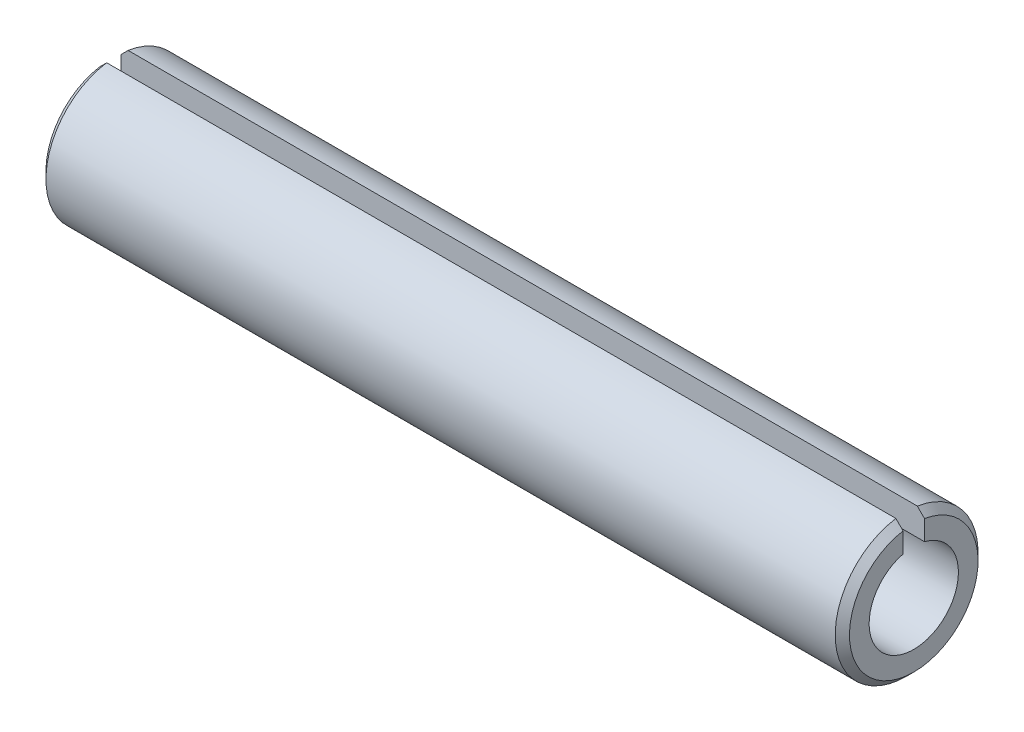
ISO-10303-21;
HEADER;
FILE_DESCRIPTION(('STEP AP214'),'2;1');
FILE_NAME('part.step','',(''),(''),'','','');
FILE_SCHEMA(('AUTOMOTIVE_DESIGN { 1 0 10303 214 1 1 1 1 }'));
ENDSEC;
DATA;
#1=APPLICATION_CONTEXT('core data for automotive mechanical design processes');
#2=APPLICATION_PROTOCOL_DEFINITION('international standard','automotive_design',2000,#1);
#3=PRODUCT_CONTEXT('',#1,'mechanical');
#4=PRODUCT('Part','Part','',(#3));
#5=PRODUCT_RELATED_PRODUCT_CATEGORY('part','',(#4));
#6=PRODUCT_DEFINITION_FORMATION('','',#4);
#7=PRODUCT_DEFINITION_CONTEXT('part definition',#1,'design');
#8=PRODUCT_DEFINITION('design','',#6,#7);
#9=PRODUCT_DEFINITION_SHAPE('','',#8);
#10=(LENGTH_UNIT() NAMED_UNIT(*) SI_UNIT(.MILLI.,.METRE.));
#11=(NAMED_UNIT(*) PLANE_ANGLE_UNIT() SI_UNIT($,.RADIAN.));
#12=(NAMED_UNIT(*) SI_UNIT($,.STERADIAN.) SOLID_ANGLE_UNIT());
#13=UNCERTAINTY_MEASURE_WITH_UNIT(LENGTH_MEASURE(1.E-05),#10,'distance_accuracy_value','');
#14=(GEOMETRIC_REPRESENTATION_CONTEXT(3) GLOBAL_UNCERTAINTY_ASSIGNED_CONTEXT((#13)) GLOBAL_UNIT_ASSIGNED_CONTEXT((#10,
#11,#12)) REPRESENTATION_CONTEXT('',''));
#15=CARTESIAN_POINT('',(0.,0.,0.));
#16=DIRECTION('',(0.,0.,1.));
#17=DIRECTION('',(1.,0.,0.));
#18=AXIS2_PLACEMENT_3D('',#15,#16,#17);
#19=CARTESIAN_POINT('',(0.,3.88578058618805E-13,0.));
#20=DIRECTION('',(-1.,0.,0.));
#21=DIRECTION('',(0.,0.,1.));
#22=AXIS2_PLACEMENT_3D('',#19,#20,#21);
#23=CYLINDRICAL_SURFACE('',#22,2.5);
#24=DIRECTION('',(-1.,0.,0.));
#25=VECTOR('',#24,1.);
#26=CARTESIAN_POINT('',(45.0000000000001,2.42693221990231,0.600000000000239));
#27=LINE('',#26,#25);
#28=CARTESIAN_POINT('',(45.0000000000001,2.42693221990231,0.600000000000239));
#29=VERTEX_POINT('',#28);
#30=CARTESIAN_POINT('',(0.,2.42693221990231,0.599999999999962));
#31=VERTEX_POINT('',#30);
#32=EDGE_CURVE('E45',#29,#31,#27,.T.);
#33=ORIENTED_EDGE('',*,*,#32,.F.);
#34=CARTESIAN_POINT('',(45.0000000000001,3.88578058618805E-13,-1.38777878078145E-13));
#35=DIRECTION('',(-1.,0.,0.));
#36=DIRECTION('',(0.,0.,1.));
#37=AXIS2_PLACEMENT_3D('',#34,#35,#36);
#38=CIRCLE('',#37,2.5);
#39=CARTESIAN_POINT('',(45.0000000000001,2.42693221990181,-0.600000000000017));
#40=VERTEX_POINT('',#39);
#41=EDGE_CURVE('E87',#40,#29,#38,.T.);
#42=ORIENTED_EDGE('',*,*,#41,.F.);
#43=DIRECTION('',(-1.,0.,0.));
#44=VECTOR('',#43,1.);
#45=CARTESIAN_POINT('',(45.0000000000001,2.42693221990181,-0.600000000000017));
#46=LINE('',#45,#44);
#47=CARTESIAN_POINT('',(0.,2.42693221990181,-0.599999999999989));
#48=VERTEX_POINT('',#47);
#49=EDGE_CURVE('E81',#40,#48,#46,.T.);
#50=ORIENTED_EDGE('',*,*,#49,.T.);
#51=CARTESIAN_POINT('',(0.,3.88578058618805E-13,0.));
#52=DIRECTION('',(-1.,0.,0.));
#53=DIRECTION('',(0.,0.,1.));
#54=AXIS2_PLACEMENT_3D('',#51,#52,#53);
#55=CIRCLE('',#54,2.5);
#56=EDGE_CURVE('E91',#48,#31,#55,.T.);
#57=ORIENTED_EDGE('',*,*,#56,.T.);
#58=EDGE_LOOP('',(#33,#42,#50,#57));
#59=FACE_BOUND('',#58,.T.);
#60=ADVANCED_FACE('F31',(#59),#23,.F.);
#61=CARTESIAN_POINT('',(45.,2.50000000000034,-1.66533453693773E-13));
#62=DIRECTION('',(-1.,0.,0.));
#63=DIRECTION('',(0.,0.,1.));
#64=AXIS2_PLACEMENT_3D('',#61,#62,#63);
#65=PLANE('',#64);
#66=DIRECTION('',(0.,-0.999999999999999,0.));
#67=VECTOR('',#66,1.);
#68=CARTESIAN_POINT('',(45.0000000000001,3.95474398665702,0.599999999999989));
#69=LINE('',#68,#67);
#70=CARTESIAN_POINT('',(45.0000000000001,3.54964786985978,0.599999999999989));
#71=VERTEX_POINT('',#70);
#72=EDGE_CURVE('E123',#71,#29,#69,.T.);
#73=ORIENTED_EDGE('',*,*,#72,.F.);
#74=CARTESIAN_POINT('',(45.0000000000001,3.88578058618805E-13,-1.38777878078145E-13));
#75=DIRECTION('',(-1.,0.,0.));
#76=DIRECTION('',(0.,0.,1.));
#77=AXIS2_PLACEMENT_3D('',#74,#75,#76);
#78=CIRCLE('',#77,3.60000000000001);
#79=CARTESIAN_POINT('',(45.,3.54964786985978,-0.600000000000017));
#80=VERTEX_POINT('',#79);
#81=EDGE_CURVE('E116',#80,#71,#78,.T.);
#82=ORIENTED_EDGE('',*,*,#81,.F.);
#83=DIRECTION('',(0.,-0.999999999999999,0.));
#84=VECTOR('',#83,1.);
#85=CARTESIAN_POINT('',(45.0000000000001,3.95474398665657,-0.6000000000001));
#86=LINE('',#85,#84);
#87=EDGE_CURVE('E124',#80,#40,#86,.T.);
#88=ORIENTED_EDGE('',*,*,#87,.T.);
#89=ORIENTED_EDGE('',*,*,#41,.T.);
#90=EDGE_LOOP('',(#73,#82,#88,#89));
#91=FACE_BOUND('',#90,.T.);
#92=ADVANCED_FACE('F121',(#91),#65,.F.);
#93=CARTESIAN_POINT('',(45.0000000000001,3.88578058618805E-13,-1.38777878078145E-13));
#94=DIRECTION('',(-1.,0.,0.));
#95=DIRECTION('',(0.,0.,1.));
#96=AXIS2_PLACEMENT_3D('',#93,#94,#95);
#97=CONICAL_SURFACE('',#96,3.60000000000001,0.785398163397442);
#98=CARTESIAN_POINT('',(42.8731044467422,5.6953781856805,0.600000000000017));
#99=CARTESIAN_POINT('',(43.0494236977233,5.51807770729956,0.599999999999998));
#100=CARTESIAN_POINT('',(43.2257027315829,5.34073717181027,0.599999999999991));
#101=CARTESIAN_POINT('',(43.5781365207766,4.98593500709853,0.599999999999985));
#102=CARTESIAN_POINT('',(43.7542912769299,4.80847337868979,0.599999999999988));
#103=CARTESIAN_POINT('',(44.1064277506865,4.45339301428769,0.59999999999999));
#104=CARTESIAN_POINT('',(44.2824094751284,4.2757742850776,0.599999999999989));
#105=CARTESIAN_POINT('',(44.6341356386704,3.92029946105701,0.599999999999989));
#106=CARTESIAN_POINT('',(44.809880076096,3.74244336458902,0.599999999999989));
#107=CARTESIAN_POINT('',(45.1610200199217,3.38636336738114,0.59999999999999));
#108=CARTESIAN_POINT('',(45.3364155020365,3.2081394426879,0.59999999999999));
#109=CARTESIAN_POINT('',(45.6866304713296,2.85113122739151,0.599999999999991));
#110=CARTESIAN_POINT('',(45.8614499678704,2.67234694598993,0.599999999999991));
#111=CARTESIAN_POINT('',(46.1229123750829,2.40341280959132,0.599999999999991));
#112=CARTESIAN_POINT('',(46.2099416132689,2.31363878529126,0.599999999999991));
#113=CARTESIAN_POINT('',(46.3836327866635,2.1337376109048,0.599999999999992));
#114=CARTESIAN_POINT('',(46.4702947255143,2.04361046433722,0.599999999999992));
#115=CARTESIAN_POINT('',(46.6430946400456,1.86284399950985,0.599999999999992));
#116=CARTESIAN_POINT('',(46.7292325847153,1.77220465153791,0.599999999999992));
#117=CARTESIAN_POINT('',(46.8578267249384,1.63566518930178,0.599999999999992));
#118=CARTESIAN_POINT('',(46.9005900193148,1.59005452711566,0.599999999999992));
#119=CARTESIAN_POINT('',(46.9858494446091,1.49858326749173,0.599999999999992));
#120=CARTESIAN_POINT('',(47.0283455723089,1.45272266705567,0.599999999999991));
#121=CARTESIAN_POINT('',(47.0706763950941,1.40670916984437,0.599999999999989));
#122=B_SPLINE_CURVE_WITH_KNOTS('',3,(#98,#99,#100,#101,#102,#103,#104,#105,#106,#107,#108,#109,
#110,#111,#112,#113,#114,#115,#116,#117,#118,#119,#120,#121),.UNSPECIFIED.,.F.,.F.,(4,2,2,2,2,2,
2,2,2,2,2,4),(0.,0.750143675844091,1.50028235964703,2.25039009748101,3.00050310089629,
3.75066659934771,4.50081784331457,4.87591865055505,5.25101572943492,5.62613479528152,
5.81370060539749,6.00126867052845),.UNSPECIFIED.);
#123=CARTESIAN_POINT('',(44.6,3.95474398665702,0.600000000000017));
#124=VERTEX_POINT('',#123);
#125=EDGE_CURVE('E97',#124,#71,#122,.T.);
#126=ORIENTED_EDGE('',*,*,#125,.F.);
#127=CARTESIAN_POINT('',(44.6,0.,0.));
#128=DIRECTION('',(-1.,0.,0.));
#129=DIRECTION('',(0.,0.,1.));
#130=AXIS2_PLACEMENT_3D('',#127,#128,#129);
#131=CIRCLE('',#130,4.00000000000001);
#132=CARTESIAN_POINT('',(44.6,3.95474398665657,-0.6000000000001));
#133=VERTEX_POINT('',#132);
#134=EDGE_CURVE('E113',#133,#124,#131,.T.);
#135=ORIENTED_EDGE('',*,*,#134,.F.);
#136=CARTESIAN_POINT('',(42.8731044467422,5.69537818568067,-0.600000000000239));
#137=CARTESIAN_POINT('',(43.0494236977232,5.51807770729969,-0.600000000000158));
#138=CARTESIAN_POINT('',(43.2257027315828,5.34073717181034,-0.600000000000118));
#139=CARTESIAN_POINT('',(43.5781365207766,4.98593500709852,-0.600000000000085));
#140=CARTESIAN_POINT('',(43.7542912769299,4.80847337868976,-0.600000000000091));
#141=CARTESIAN_POINT('',(44.1064277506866,4.45339301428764,-0.600000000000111));
#142=CARTESIAN_POINT('',(44.2824094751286,4.27577428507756,-0.600000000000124));
#143=CARTESIAN_POINT('',(44.6341356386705,3.92029946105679,-0.600000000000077));
#144=CARTESIAN_POINT('',(44.809880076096,3.7424433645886,-0.600000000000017));
#145=CARTESIAN_POINT('',(45.1610200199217,3.3863633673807,-0.600000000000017));
#146=CARTESIAN_POINT('',(45.3364155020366,3.20813944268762,-0.600000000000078));
#147=CARTESIAN_POINT('',(45.6866304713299,2.85113122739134,-0.600000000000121));
#148=CARTESIAN_POINT('',(45.8614499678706,2.67234694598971,-0.600000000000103));
#149=CARTESIAN_POINT('',(46.1229123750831,2.40341280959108,-0.600000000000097));
#150=CARTESIAN_POINT('',(46.2099416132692,2.31363878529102,-0.600000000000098));
#151=CARTESIAN_POINT('',(46.3836327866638,2.13373761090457,-0.600000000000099));
#152=CARTESIAN_POINT('',(46.4702947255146,2.04361046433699,-0.6000000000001));
#153=CARTESIAN_POINT('',(46.6430946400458,1.86284399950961,-0.600000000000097));
#154=CARTESIAN_POINT('',(46.7292325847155,1.77220465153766,-0.600000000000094));
#155=CARTESIAN_POINT('',(46.8578267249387,1.63566518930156,-0.6000000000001));
#156=CARTESIAN_POINT('',(46.9005900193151,1.59005452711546,-0.600000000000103));
#157=CARTESIAN_POINT('',(46.9858494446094,1.49858326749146,-0.600000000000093));
#158=CARTESIAN_POINT('',(47.028345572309,1.45272266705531,-0.600000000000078));
#159=CARTESIAN_POINT('',(47.070676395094,1.40670916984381,-0.600000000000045));
#160=B_SPLINE_CURVE_WITH_KNOTS('',3,(#136,#137,#138,#139,#140,#141,#142,#143,#144,#145,#146,
#147,#148,#149,#150,#151,#152,#153,#154,#155,#156,#157,#158,#159),.UNSPECIFIED.,.F.,.F.,(4,2,2,
2,2,2,2,2,2,2,2,4),(0.,0.750143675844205,1.50028235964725,2.25039009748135,3.00050310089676,
3.75066659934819,4.50081784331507,4.87591865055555,5.25101572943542,5.62613479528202,
5.81370060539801,6.00126867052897),.UNSPECIFIED.);
#161=EDGE_CURVE('E141',#133,#80,#160,.T.);
#162=ORIENTED_EDGE('',*,*,#161,.T.);
#163=ORIENTED_EDGE('',*,*,#81,.T.);
#164=EDGE_LOOP('',(#126,#135,#162,#163));
#165=FACE_BOUND('',#164,.T.);
#166=ADVANCED_FACE('F165',(#165),#97,.T.);
#167=CARTESIAN_POINT('',(0.,3.88578058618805E-13,0.));
#168=DIRECTION('',(-1.,0.,0.));
#169=DIRECTION('',(0.,0.,1.));
#170=AXIS2_PLACEMENT_3D('',#167,#168,#169);
#171=CYLINDRICAL_SURFACE('',#170,4.);
#172=DIRECTION('',(-1.,0.,0.));
#173=VECTOR('',#172,1.);
#174=CARTESIAN_POINT('',(45.0000000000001,3.95474398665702,0.599999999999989));
#175=LINE('',#174,#173);
#176=CARTESIAN_POINT('',(0.399999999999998,3.95474398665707,0.600000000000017));
#177=VERTEX_POINT('',#176);
#178=EDGE_CURVE('E131',#124,#177,#175,.T.);
#179=ORIENTED_EDGE('',*,*,#178,.T.);
#180=CARTESIAN_POINT('',(0.399999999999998,3.88578058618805E-13,0.));
#181=DIRECTION('',(-1.,0.,0.));
#182=DIRECTION('',(0.,0.,1.));
#183=AXIS2_PLACEMENT_3D('',#180,#181,#182);
#184=CIRCLE('',#183,4.);
#185=CARTESIAN_POINT('',(0.400000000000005,3.95474398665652,-0.600000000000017));
#186=VERTEX_POINT('',#185);
#187=EDGE_CURVE('E99',#186,#177,#184,.T.);
#188=ORIENTED_EDGE('',*,*,#187,.F.);
#189=DIRECTION('',(-1.,0.,0.));
#190=VECTOR('',#189,1.);
#191=CARTESIAN_POINT('',(45.0000000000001,3.95474398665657,-0.6000000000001));
#192=LINE('',#191,#190);
#193=EDGE_CURVE('E93',#133,#186,#192,.T.);
#194=ORIENTED_EDGE('',*,*,#193,.F.);
#195=ORIENTED_EDGE('',*,*,#134,.T.);
#196=EDGE_LOOP('',(#179,#188,#194,#195));
#197=FACE_BOUND('',#196,.T.);
#198=ADVANCED_FACE('F169',(#197),#171,.T.);
#199=CARTESIAN_POINT('',(0.399999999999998,3.88578058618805E-13,0.));
#200=DIRECTION('',(1.,0.,0.));
#201=DIRECTION('',(0.,0.,-1.));
#202=AXIS2_PLACEMENT_3D('',#199,#200,#201);
#203=CONICAL_SURFACE('',#202,4.,0.785398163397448);
#204=CARTESIAN_POINT('',(-2.07067639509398,1.40670916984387,0.599999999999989));
#205=CARTESIAN_POINT('',(-2.02011415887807,1.46166506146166,0.599999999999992));
#206=CARTESIAN_POINT('',(-1.96932000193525,1.51640610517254,0.599999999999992));
#207=CARTESIAN_POINT('',(-1.86736787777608,1.62554685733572,0.59999999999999));
#208=CARTESIAN_POINT('',(-1.81620991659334,1.67994657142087,0.59999999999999));
#209=CARTESIAN_POINT('',(-1.66234187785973,1.84276470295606,0.599999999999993));
#210=CARTESIAN_POINT('',(-1.55923365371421,1.95080641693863,0.600000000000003));
#211=CARTESIAN_POINT('',(-1.35237956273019,2.16626307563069,0.599999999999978));
#212=CARTESIAN_POINT('',(-1.24863373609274,2.27367805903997,0.599999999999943));
#213=CARTESIAN_POINT('',(-1.04071524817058,2.48809612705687,0.600000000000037));
#214=CARTESIAN_POINT('',(-0.936542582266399,2.59509920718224,0.600000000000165));
#215=CARTESIAN_POINT('',(-0.69150769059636,2.84610384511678,0.600000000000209));
#216=CARTESIAN_POINT('',(-0.550525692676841,2.98998839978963,0.600000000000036));
#217=CARTESIAN_POINT('',(-0.268216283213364,3.27742366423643,0.599999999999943));
#218=CARTESIAN_POINT('',(-0.126888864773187,3.42097436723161,0.600000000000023));
#219=CARTESIAN_POINT('',(0.190127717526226,3.74245168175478,0.600000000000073));
#220=CARTESIAN_POINT('',(0.365880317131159,3.92031572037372,0.600000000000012));
#221=CARTESIAN_POINT('',(0.717623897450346,4.27580788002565,0.599999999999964));
#222=CARTESIAN_POINT('',(0.893614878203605,4.45343600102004,0.599999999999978));
#223=CARTESIAN_POINT('',(1.24575266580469,4.80851768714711,0.599999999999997));
#224=CARTESIAN_POINT('',(1.42189946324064,4.98597126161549,0.600000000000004));
#225=CARTESIAN_POINT('',(1.7743159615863,5.34075596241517,0.599999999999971));
#226=CARTESIAN_POINT('',(1.95058566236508,5.51808708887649,0.599999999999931));
#227=CARTESIAN_POINT('',(2.12689555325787,5.6953781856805,0.599999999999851));
#228=B_SPLINE_CURVE_WITH_KNOTS('',3,(#204,#205,#206,#207,#208,#209,#210,#211,#212,#213,#214,
#215,#216,#217,#218,#219,#220,#221,#222,#223,#224,#225,#226,#227),.UNSPECIFIED.,.F.,.F.,(4,2,2,
2,2,2,2,2,2,2,2,4),(0.,0.224029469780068,0.448055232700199,0.896089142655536,1.34409508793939,
1.79210589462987,2.39642954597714,3.00076536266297,3.75091253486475,4.50105982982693,
5.25116454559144,6.00126846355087),.UNSPECIFIED.);
#229=CARTESIAN_POINT('',(0.,3.54964786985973,0.599999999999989));
#230=VERTEX_POINT('',#229);
#231=EDGE_CURVE('E101',#230,#177,#228,.T.);
#232=ORIENTED_EDGE('',*,*,#231,.F.);
#233=CARTESIAN_POINT('',(0.,3.88578058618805E-13,0.));
#234=DIRECTION('',(-1.,0.,0.));
#235=DIRECTION('',(0.,0.,1.));
#236=AXIS2_PLACEMENT_3D('',#233,#234,#235);
#237=CIRCLE('',#236,3.60000000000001);
#238=CARTESIAN_POINT('',(0.,3.54964786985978,-0.600000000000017));
#239=VERTEX_POINT('',#238);
#240=EDGE_CURVE('E96',#239,#230,#237,.T.);
#241=ORIENTED_EDGE('',*,*,#240,.F.);
#242=CARTESIAN_POINT('',(-2.07067639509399,1.40670916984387,-0.600000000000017));
#243=CARTESIAN_POINT('',(-2.02011415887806,1.46166506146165,-0.600000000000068));
#244=CARTESIAN_POINT('',(-1.96932000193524,1.51640610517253,-0.600000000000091));
#245=CARTESIAN_POINT('',(-1.86736787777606,1.62554685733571,-0.600000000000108));
#246=CARTESIAN_POINT('',(-1.81620991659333,1.67994657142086,-0.600000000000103));
#247=CARTESIAN_POINT('',(-1.66234187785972,1.84276470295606,-0.600000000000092));
#248=CARTESIAN_POINT('',(-1.5592336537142,1.95080641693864,-0.600000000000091));
#249=CARTESIAN_POINT('',(-1.35237956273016,2.16626307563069,-0.600000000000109));
#250=CARTESIAN_POINT('',(-1.24863373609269,2.27367805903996,-0.600000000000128));
#251=CARTESIAN_POINT('',(-1.04071524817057,2.48809612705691,-0.600000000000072));
#252=CARTESIAN_POINT('',(-0.936542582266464,2.59509920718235,-0.599999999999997));
#253=CARTESIAN_POINT('',(-0.691507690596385,2.84610384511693,-0.59999999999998));
#254=CARTESIAN_POINT('',(-0.550525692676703,2.98998839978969,-0.600000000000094));
#255=CARTESIAN_POINT('',(-0.268216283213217,3.27742366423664,-0.600000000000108));
#256=CARTESIAN_POINT('',(-0.126888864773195,3.42097436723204,-0.600000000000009));
#257=CARTESIAN_POINT('',(0.190127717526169,3.7424516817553,-0.599999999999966));
#258=CARTESIAN_POINT('',(0.365880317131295,3.920315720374,-0.600000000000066));
#259=CARTESIAN_POINT('',(0.7176238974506,4.27580788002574,-0.600000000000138));
#260=CARTESIAN_POINT('',(0.893614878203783,4.45343600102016,-0.60000000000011));
#261=CARTESIAN_POINT('',(1.24575266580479,4.80851768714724,-0.600000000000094));
#262=CARTESIAN_POINT('',(1.42189946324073,4.9859712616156,-0.600000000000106));
#263=CARTESIAN_POINT('',(1.77431596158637,5.34075596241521,-0.6000000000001));
#264=CARTESIAN_POINT('',(1.95058566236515,5.5180870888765,-0.600000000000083));
#265=CARTESIAN_POINT('',(2.1268955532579,5.6953781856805,-0.600000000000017));
#266=B_SPLINE_CURVE_WITH_KNOTS('',3,(#242,#243,#244,#245,#246,#247,#248,#249,#250,#251,#252,
#253,#254,#255,#256,#257,#258,#259,#260,#261,#262,#263,#264,#265),.UNSPECIFIED.,.F.,.F.,(4,2,2,
2,2,2,2,2,2,2,2,4),(0.,0.224029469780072,0.448055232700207,0.896089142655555,1.34409508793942,
1.79210589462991,2.39642954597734,3.00076536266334,3.75091253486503,4.50105982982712,
5.25116454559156,6.0012684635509),.UNSPECIFIED.);
#267=EDGE_CURVE('E52',#239,#186,#266,.T.);
#268=ORIENTED_EDGE('',*,*,#267,.T.);
#269=ORIENTED_EDGE('',*,*,#187,.T.);
#270=EDGE_LOOP('',(#232,#241,#268,#269));
#271=FACE_BOUND('',#270,.T.);
#272=ADVANCED_FACE('F146',(#271),#203,.T.);
#273=CARTESIAN_POINT('',(0.,2.5000000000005,0.));
#274=DIRECTION('',(-1.,0.,0.));
#275=DIRECTION('',(0.,0.,1.));
#276=AXIS2_PLACEMENT_3D('',#273,#274,#275);
#277=PLANE('',#276);
#278=ORIENTED_EDGE('',*,*,#240,.T.);
#279=DIRECTION('',(0.,-0.999999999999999,0.));
#280=VECTOR('',#279,1.);
#281=CARTESIAN_POINT('',(0.,2.5,0.599999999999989));
#282=LINE('',#281,#280);
#283=EDGE_CURVE('E11',#230,#31,#282,.T.);
#284=ORIENTED_EDGE('',*,*,#283,.T.);
#285=ORIENTED_EDGE('',*,*,#56,.F.);
#286=DIRECTION('',(0.,-0.999999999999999,0.));
#287=VECTOR('',#286,1.);
#288=CARTESIAN_POINT('',(0.,2.5,-0.600000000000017));
#289=LINE('',#288,#287);
#290=EDGE_CURVE('E38',#239,#48,#289,.T.);
#291=ORIENTED_EDGE('',*,*,#290,.F.);
#292=EDGE_LOOP('',(#278,#284,#285,#291));
#293=FACE_BOUND('',#292,.T.);
#294=ADVANCED_FACE('F95',(#293),#277,.T.);
#295=CARTESIAN_POINT('',(45.0000000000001,3.95474398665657,-0.6000000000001));
#296=DIRECTION('',(0.,0.,-1.));
#297=DIRECTION('',(0.,0.999999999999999,0.));
#298=AXIS2_PLACEMENT_3D('',#295,#296,#297);
#299=PLANE('',#298);
#300=ORIENTED_EDGE('',*,*,#193,.T.);
#301=ORIENTED_EDGE('',*,*,#267,.F.);
#302=ORIENTED_EDGE('',*,*,#290,.T.);
#303=ORIENTED_EDGE('',*,*,#49,.F.);
#304=ORIENTED_EDGE('',*,*,#87,.F.);
#305=ORIENTED_EDGE('',*,*,#161,.F.);
#306=EDGE_LOOP('',(#300,#301,#302,#303,#304,#305));
#307=FACE_BOUND('',#306,.T.);
#308=ADVANCED_FACE('F80',(#307),#299,.F.);
#309=CARTESIAN_POINT('',(45.0000000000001,3.95474398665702,0.599999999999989));
#310=DIRECTION('',(0.,0.,-1.));
#311=DIRECTION('',(0.,0.999999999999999,0.));
#312=AXIS2_PLACEMENT_3D('',#309,#310,#311);
#313=PLANE('',#312);
#314=ORIENTED_EDGE('',*,*,#125,.T.);
#315=ORIENTED_EDGE('',*,*,#72,.T.);
#316=ORIENTED_EDGE('',*,*,#32,.T.);
#317=ORIENTED_EDGE('',*,*,#283,.F.);
#318=ORIENTED_EDGE('',*,*,#231,.T.);
#319=ORIENTED_EDGE('',*,*,#178,.F.);
#320=EDGE_LOOP('',(#314,#315,#316,#317,#318,#319));
#321=FACE_BOUND('',#320,.T.);
#322=ADVANCED_FACE('F152',(#321),#313,.T.);
#323=CLOSED_SHELL('',(#60,#92,#166,#198,#272,#294,#308,#322));
#324=MANIFOLD_SOLID_BREP('B2',#323);
#325=ADVANCED_BREP_SHAPE_REPRESENTATION('',(#18,#324),#14);
#326=SHAPE_DEFINITION_REPRESENTATION(#9,#325);
ENDSEC;
END-ISO-10303-21;
